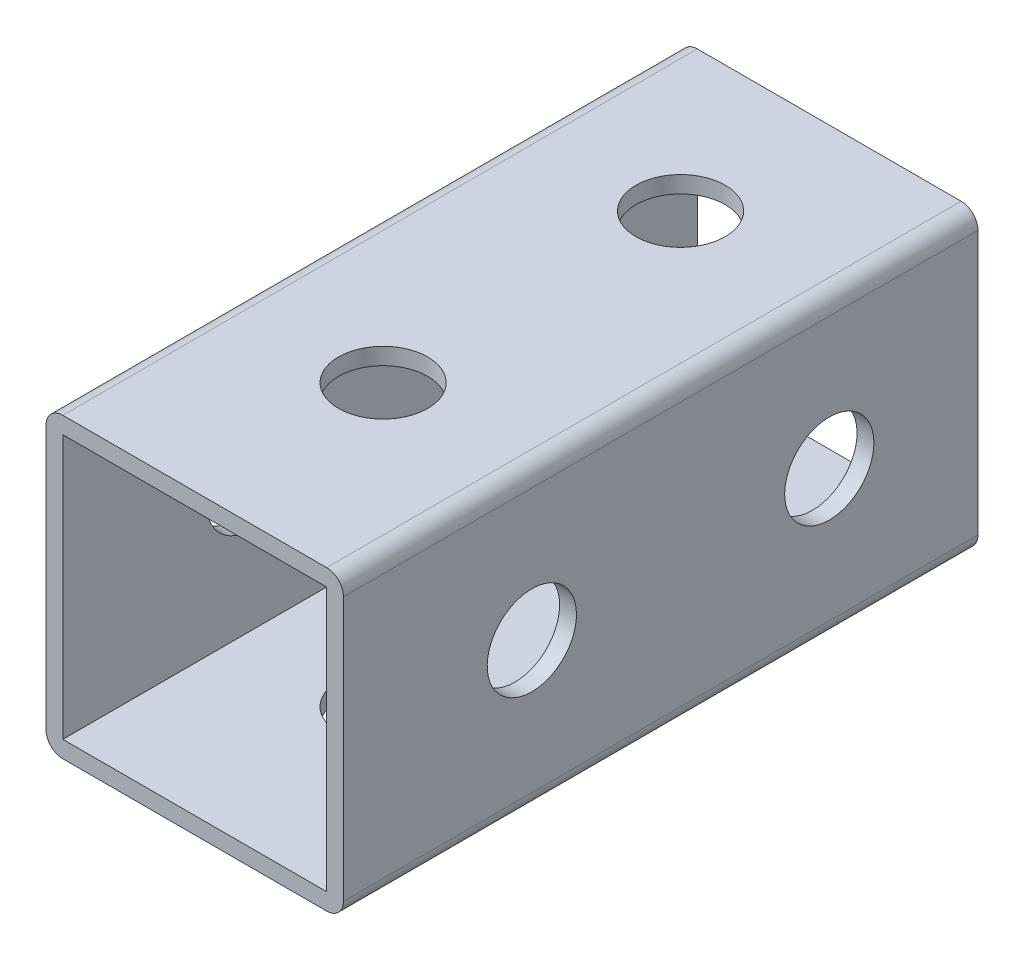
ISO-10303-21;
HEADER;
FILE_DESCRIPTION(('STEP AP214'),'2;1');
FILE_NAME('part.step','',(''),(''),'','','');
FILE_SCHEMA(('AUTOMOTIVE_DESIGN { 1 0 10303 214 1 1 1 1 }'));
ENDSEC;
DATA;
#1=APPLICATION_CONTEXT('core data for automotive mechanical design processes');
#2=APPLICATION_PROTOCOL_DEFINITION('international standard','automotive_design',2000,#1);
#3=PRODUCT_CONTEXT('',#1,'mechanical');
#4=PRODUCT('Part','Part','',(#3));
#5=PRODUCT_RELATED_PRODUCT_CATEGORY('part','',(#4));
#6=PRODUCT_DEFINITION_FORMATION('','',#4);
#7=PRODUCT_DEFINITION_CONTEXT('part definition',#1,'design');
#8=PRODUCT_DEFINITION('design','',#6,#7);
#9=PRODUCT_DEFINITION_SHAPE('','',#8);
#10=(LENGTH_UNIT() NAMED_UNIT(*) SI_UNIT(.MILLI.,.METRE.));
#11=(NAMED_UNIT(*) PLANE_ANGLE_UNIT() SI_UNIT($,.RADIAN.));
#12=(NAMED_UNIT(*) SI_UNIT($,.STERADIAN.) SOLID_ANGLE_UNIT());
#13=UNCERTAINTY_MEASURE_WITH_UNIT(LENGTH_MEASURE(1.E-05),#10,'distance_accuracy_value','');
#14=(GEOMETRIC_REPRESENTATION_CONTEXT(3) GLOBAL_UNCERTAINTY_ASSIGNED_CONTEXT((#13)) GLOBAL_UNIT_ASSIGNED_CONTEXT((#10,
#11,#12)) REPRESENTATION_CONTEXT('',''));
#15=CARTESIAN_POINT('',(0.,0.,0.));
#16=DIRECTION('',(0.,0.,1.));
#17=DIRECTION('',(1.,0.,0.));
#18=AXIS2_PLACEMENT_3D('',#15,#16,#17);
#19=CARTESIAN_POINT('',(21.1201,21.1201,101.6));
#20=DIRECTION('',(0.,0.,-1.));
#21=DIRECTION('',(-1.,0.,0.));
#22=AXIS2_PLACEMENT_3D('',#19,#20,#21);
#23=PLANE('',#22);
#24=CARTESIAN_POINT('',(21.1201,21.1201,101.6));
#25=DIRECTION('',(0.,0.,1.));
#26=DIRECTION('',(-1.,0.,0.));
#27=AXIS2_PLACEMENT_3D('',#24,#25,#26);
#28=CIRCLE('',#27,2.6924);
#29=CARTESIAN_POINT('',(23.8125,21.1201,101.6));
#30=VERTEX_POINT('',#29);
#31=CARTESIAN_POINT('',(21.1201,23.8125,101.6));
#32=VERTEX_POINT('',#31);
#33=EDGE_CURVE('E162',#30,#32,#28,.T.);
#34=ORIENTED_EDGE('',*,*,#33,.T.);
#35=DIRECTION('',(-1.,0.,0.));
#36=VECTOR('',#35,1.);
#37=CARTESIAN_POINT('',(-21.1201,23.8125,101.6));
#38=LINE('',#37,#36);
#39=CARTESIAN_POINT('',(-21.1201,23.8125,101.6));
#40=VERTEX_POINT('',#39);
#41=EDGE_CURVE('E165',#32,#40,#38,.T.);
#42=ORIENTED_EDGE('',*,*,#41,.T.);
#43=CARTESIAN_POINT('',(-21.1201,21.1201,101.6));
#44=DIRECTION('',(0.,0.,1.));
#45=DIRECTION('',(1.,0.,0.));
#46=AXIS2_PLACEMENT_3D('',#43,#44,#45);
#47=CIRCLE('',#46,2.69240000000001);
#48=CARTESIAN_POINT('',(-23.8125,21.1201,101.6));
#49=VERTEX_POINT('',#48);
#50=EDGE_CURVE('E168',#40,#49,#47,.T.);
#51=ORIENTED_EDGE('',*,*,#50,.T.);
#52=DIRECTION('',(0.,-1.,0.));
#53=VECTOR('',#52,1.);
#54=CARTESIAN_POINT('',(-23.8125,21.1201,101.6));
#55=LINE('',#54,#53);
#56=CARTESIAN_POINT('',(-23.8125,-21.1201,101.6));
#57=VERTEX_POINT('',#56);
#58=EDGE_CURVE('E170',#49,#57,#55,.T.);
#59=ORIENTED_EDGE('',*,*,#58,.T.);
#60=CARTESIAN_POINT('',(-21.1201,-21.1201,101.6));
#61=DIRECTION('',(0.,0.,1.));
#62=DIRECTION('',(-1.,0.,0.));
#63=AXIS2_PLACEMENT_3D('',#60,#61,#62);
#64=CIRCLE('',#63,2.69240000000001);
#65=CARTESIAN_POINT('',(-21.1201,-23.8125,101.6));
#66=VERTEX_POINT('',#65);
#67=EDGE_CURVE('E172',#57,#66,#64,.T.);
#68=ORIENTED_EDGE('',*,*,#67,.T.);
#69=DIRECTION('',(1.,0.,0.));
#70=VECTOR('',#69,1.);
#71=CARTESIAN_POINT('',(-21.1201,-23.8125,101.6));
#72=LINE('',#71,#70);
#73=CARTESIAN_POINT('',(21.1201,-23.8125,101.6));
#74=VERTEX_POINT('',#73);
#75=EDGE_CURVE('E174',#66,#74,#72,.T.);
#76=ORIENTED_EDGE('',*,*,#75,.T.);
#77=CARTESIAN_POINT('',(21.1201,-21.1201,101.6));
#78=DIRECTION('',(0.,0.,1.));
#79=DIRECTION('',(1.,0.,0.));
#80=AXIS2_PLACEMENT_3D('',#77,#78,#79);
#81=CIRCLE('',#80,2.6924);
#82=CARTESIAN_POINT('',(23.8125,-21.1201,101.6));
#83=VERTEX_POINT('',#82);
#84=EDGE_CURVE('E176',#74,#83,#81,.T.);
#85=ORIENTED_EDGE('',*,*,#84,.T.);
#86=DIRECTION('',(0.,1.,0.));
#87=VECTOR('',#86,1.);
#88=CARTESIAN_POINT('',(23.8125,-21.1201,101.6));
#89=LINE('',#88,#87);
#90=EDGE_CURVE('E178',#83,#30,#89,.T.);
#91=ORIENTED_EDGE('',*,*,#90,.T.);
#92=EDGE_LOOP('',(#34,#42,#51,#59,#68,#76,#85,#91));
#93=FACE_BOUND('',#92,.T.);
#94=DIRECTION('',(0.,1.,0.));
#95=VECTOR('',#94,1.);
#96=CARTESIAN_POINT('',(21.1201,-21.1201,101.6));
#97=LINE('',#96,#95);
#98=CARTESIAN_POINT('',(21.1201,-21.1201,101.6));
#99=VERTEX_POINT('',#98);
#100=CARTESIAN_POINT('',(21.1201,21.1201,101.6));
#101=VERTEX_POINT('',#100);
#102=EDGE_CURVE('E124',#99,#101,#97,.T.);
#103=ORIENTED_EDGE('',*,*,#102,.F.);
#104=DIRECTION('',(1.,0.,0.));
#105=VECTOR('',#104,1.);
#106=CARTESIAN_POINT('',(-21.1201,-21.1201,101.6));
#107=LINE('',#106,#105);
#108=CARTESIAN_POINT('',(-21.1201,-21.1201,101.6));
#109=VERTEX_POINT('',#108);
#110=EDGE_CURVE('E146',#109,#99,#107,.T.);
#111=ORIENTED_EDGE('',*,*,#110,.F.);
#112=DIRECTION('',(0.,-1.,0.));
#113=VECTOR('',#112,1.);
#114=CARTESIAN_POINT('',(-21.1201,21.1201,101.6));
#115=LINE('',#114,#113);
#116=CARTESIAN_POINT('',(-21.1201,21.1201,101.6));
#117=VERTEX_POINT('',#116);
#118=EDGE_CURVE('E144',#117,#109,#115,.T.);
#119=ORIENTED_EDGE('',*,*,#118,.F.);
#120=DIRECTION('',(-1.,0.,0.));
#121=VECTOR('',#120,1.);
#122=CARTESIAN_POINT('',(-21.1201,21.1201,101.6));
#123=LINE('',#122,#121);
#124=EDGE_CURVE('E132',#101,#117,#123,.T.);
#125=ORIENTED_EDGE('',*,*,#124,.F.);
#126=EDGE_LOOP('',(#103,#111,#119,#125));
#127=FACE_BOUND('',#126,.T.);
#128=ADVANCED_FACE('F33',(#93,#127),#23,.F.);
#129=CARTESIAN_POINT('',(21.1201,21.1201,0.));
#130=DIRECTION('',(0.,0.,-1.));
#131=DIRECTION('',(-1.,0.,0.));
#132=AXIS2_PLACEMENT_3D('',#129,#130,#131);
#133=PLANE('',#132);
#134=CARTESIAN_POINT('',(21.1201,21.1201,0.));
#135=DIRECTION('',(0.,0.,1.));
#136=DIRECTION('',(-1.,0.,0.));
#137=AXIS2_PLACEMENT_3D('',#134,#135,#136);
#138=CIRCLE('',#137,2.6924);
#139=CARTESIAN_POINT('',(23.8125,21.1201,0.));
#140=VERTEX_POINT('',#139);
#141=CARTESIAN_POINT('',(21.1201,23.8125,0.));
#142=VERTEX_POINT('',#141);
#143=EDGE_CURVE('E140',#140,#142,#138,.T.);
#144=ORIENTED_EDGE('',*,*,#143,.F.);
#145=DIRECTION('',(0.,1.,0.));
#146=VECTOR('',#145,1.);
#147=CARTESIAN_POINT('',(23.8125,-21.1201,0.));
#148=LINE('',#147,#146);
#149=CARTESIAN_POINT('',(23.8125,-21.1201,0.));
#150=VERTEX_POINT('',#149);
#151=EDGE_CURVE('E166',#150,#140,#148,.T.);
#152=ORIENTED_EDGE('',*,*,#151,.F.);
#153=CARTESIAN_POINT('',(21.1201,-21.1201,0.));
#154=DIRECTION('',(0.,0.,1.));
#155=DIRECTION('',(1.,0.,0.));
#156=AXIS2_PLACEMENT_3D('',#153,#154,#155);
#157=CIRCLE('',#156,2.6924);
#158=CARTESIAN_POINT('',(21.1201,-23.8125,0.));
#159=VERTEX_POINT('',#158);
#160=EDGE_CURVE('E193',#159,#150,#157,.T.);
#161=ORIENTED_EDGE('',*,*,#160,.F.);
#162=DIRECTION('',(1.,0.,0.));
#163=VECTOR('',#162,1.);
#164=CARTESIAN_POINT('',(-21.1201,-23.8125,0.));
#165=LINE('',#164,#163);
#166=CARTESIAN_POINT('',(-21.1201,-23.8125,0.));
#167=VERTEX_POINT('',#166);
#168=EDGE_CURVE('E191',#167,#159,#165,.T.);
#169=ORIENTED_EDGE('',*,*,#168,.F.);
#170=CARTESIAN_POINT('',(-21.1201,-21.1201,0.));
#171=DIRECTION('',(0.,0.,1.));
#172=DIRECTION('',(-1.,0.,0.));
#173=AXIS2_PLACEMENT_3D('',#170,#171,#172);
#174=CIRCLE('',#173,2.69240000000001);
#175=CARTESIAN_POINT('',(-23.8125,-21.1201,0.));
#176=VERTEX_POINT('',#175);
#177=EDGE_CURVE('E189',#176,#167,#174,.T.);
#178=ORIENTED_EDGE('',*,*,#177,.F.);
#179=DIRECTION('',(0.,-1.,0.));
#180=VECTOR('',#179,1.);
#181=CARTESIAN_POINT('',(-23.8125,21.1201,0.));
#182=LINE('',#181,#180);
#183=CARTESIAN_POINT('',(-23.8125,21.1201,0.));
#184=VERTEX_POINT('',#183);
#185=EDGE_CURVE('E187',#184,#176,#182,.T.);
#186=ORIENTED_EDGE('',*,*,#185,.F.);
#187=CARTESIAN_POINT('',(-21.1201,21.1201,0.));
#188=DIRECTION('',(0.,0.,1.));
#189=DIRECTION('',(1.,0.,0.));
#190=AXIS2_PLACEMENT_3D('',#187,#188,#189);
#191=CIRCLE('',#190,2.69240000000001);
#192=CARTESIAN_POINT('',(-21.1201,23.8125,0.));
#193=VERTEX_POINT('',#192);
#194=EDGE_CURVE('E185',#193,#184,#191,.T.);
#195=ORIENTED_EDGE('',*,*,#194,.F.);
#196=DIRECTION('',(-1.,0.,0.));
#197=VECTOR('',#196,1.);
#198=CARTESIAN_POINT('',(-21.1201,23.8125,0.));
#199=LINE('',#198,#197);
#200=EDGE_CURVE('E183',#142,#193,#199,.T.);
#201=ORIENTED_EDGE('',*,*,#200,.F.);
#202=EDGE_LOOP('',(#144,#152,#161,#169,#178,#186,#195,#201));
#203=FACE_BOUND('',#202,.T.);
#204=DIRECTION('',(1.,0.,0.));
#205=VECTOR('',#204,1.);
#206=CARTESIAN_POINT('',(-21.1201,-21.1201,0.));
#207=LINE('',#206,#205);
#208=CARTESIAN_POINT('',(-21.1201,-21.1201,0.));
#209=VERTEX_POINT('',#208);
#210=CARTESIAN_POINT('',(21.1201,-21.1201,0.));
#211=VERTEX_POINT('',#210);
#212=EDGE_CURVE('E133',#209,#211,#207,.T.);
#213=ORIENTED_EDGE('',*,*,#212,.T.);
#214=DIRECTION('',(0.,1.,0.));
#215=VECTOR('',#214,1.);
#216=CARTESIAN_POINT('',(21.1201,-21.1201,0.));
#217=LINE('',#216,#215);
#218=CARTESIAN_POINT('',(21.1201,21.1201,0.));
#219=VERTEX_POINT('',#218);
#220=EDGE_CURVE('E58',#211,#219,#217,.T.);
#221=ORIENTED_EDGE('',*,*,#220,.T.);
#222=DIRECTION('',(-1.,0.,0.));
#223=VECTOR('',#222,1.);
#224=CARTESIAN_POINT('',(-21.1201,21.1201,0.));
#225=LINE('',#224,#223);
#226=CARTESIAN_POINT('',(-21.1201,21.1201,0.));
#227=VERTEX_POINT('',#226);
#228=EDGE_CURVE('E139',#219,#227,#225,.T.);
#229=ORIENTED_EDGE('',*,*,#228,.T.);
#230=DIRECTION('',(0.,-1.,0.));
#231=VECTOR('',#230,1.);
#232=CARTESIAN_POINT('',(-21.1201,21.1201,0.));
#233=LINE('',#232,#231);
#234=EDGE_CURVE('E154',#227,#209,#233,.T.);
#235=ORIENTED_EDGE('',*,*,#234,.T.);
#236=EDGE_LOOP('',(#213,#221,#229,#235));
#237=FACE_BOUND('',#236,.T.);
#238=ADVANCED_FACE('F282',(#203,#237),#133,.T.);
#239=CARTESIAN_POINT('',(21.1201,21.1201,101.6));
#240=DIRECTION('',(0.,0.,-1.));
#241=DIRECTION('',(-1.,0.,0.));
#242=AXIS2_PLACEMENT_3D('',#239,#240,#241);
#243=CYLINDRICAL_SURFACE('',#242,2.6924);
#244=ORIENTED_EDGE('',*,*,#143,.T.);
#245=DIRECTION('',(0.,0.,-1.));
#246=VECTOR('',#245,1.);
#247=CARTESIAN_POINT('',(21.1201,23.8125,101.6));
#248=LINE('',#247,#246);
#249=EDGE_CURVE('E11',#32,#142,#248,.T.);
#250=ORIENTED_EDGE('',*,*,#249,.F.);
#251=ORIENTED_EDGE('',*,*,#33,.F.);
#252=DIRECTION('',(0.,0.,-1.));
#253=VECTOR('',#252,1.);
#254=CARTESIAN_POINT('',(23.8125,21.1201,101.6));
#255=LINE('',#254,#253);
#256=EDGE_CURVE('E180',#30,#140,#255,.T.);
#257=ORIENTED_EDGE('',*,*,#256,.T.);
#258=EDGE_LOOP('',(#244,#250,#251,#257));
#259=FACE_BOUND('',#258,.T.);
#260=ADVANCED_FACE('F35',(#259),#243,.T.);
#261=CARTESIAN_POINT('',(-21.1201,23.8125,101.6));
#262=DIRECTION('',(0.,-1.,0.));
#263=DIRECTION('',(1.,0.,0.));
#264=AXIS2_PLACEMENT_3D('',#261,#262,#263);
#265=PLANE('',#264);
#266=CARTESIAN_POINT('',(0.,23.8125,71.4375));
#267=DIRECTION('',(0.,1.,0.));
#268=DIRECTION('',(-1.,0.,0.));
#269=AXIS2_PLACEMENT_3D('',#266,#267,#268);
#270=CIRCLE('',#269,7.14375);
#271=CARTESIAN_POINT('',(-7.14375,23.8125,71.4375));
#272=VERTEX_POINT('',#271);
#273=EDGE_CURVE('E234',#272,#272,#270,.T.);
#274=ORIENTED_EDGE('',*,*,#273,.F.);
#275=EDGE_LOOP('',(#274));
#276=FACE_BOUND('',#275,.T.);
#277=CARTESIAN_POINT('',(0.,23.8125,23.8125));
#278=DIRECTION('',(0.,1.,0.));
#279=DIRECTION('',(-1.,0.,0.));
#280=AXIS2_PLACEMENT_3D('',#277,#278,#279);
#281=CIRCLE('',#280,7.14375);
#282=CARTESIAN_POINT('',(-7.14375,23.8125,23.8125));
#283=VERTEX_POINT('',#282);
#284=EDGE_CURVE('E256',#283,#283,#281,.T.);
#285=ORIENTED_EDGE('',*,*,#284,.F.);
#286=EDGE_LOOP('',(#285));
#287=FACE_BOUND('',#286,.T.);
#288=ORIENTED_EDGE('',*,*,#200,.T.);
#289=DIRECTION('',(0.,0.,-1.));
#290=VECTOR('',#289,1.);
#291=CARTESIAN_POINT('',(-21.1201,23.8125,101.6));
#292=LINE('',#291,#290);
#293=EDGE_CURVE('E42',#40,#193,#292,.T.);
#294=ORIENTED_EDGE('',*,*,#293,.F.);
#295=ORIENTED_EDGE('',*,*,#41,.F.);
#296=ORIENTED_EDGE('',*,*,#249,.T.);
#297=EDGE_LOOP('',(#288,#294,#295,#296));
#298=FACE_BOUND('',#297,.T.);
#299=ADVANCED_FACE('F311',(#276,#287,#298),#265,.F.);
#300=CARTESIAN_POINT('',(-21.1201,21.1201,101.6));
#301=DIRECTION('',(0.,0.,-1.));
#302=DIRECTION('',(-1.,0.,0.));
#303=AXIS2_PLACEMENT_3D('',#300,#301,#302);
#304=CYLINDRICAL_SURFACE('',#303,2.69240000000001);
#305=ORIENTED_EDGE('',*,*,#194,.T.);
#306=DIRECTION('',(0.,0.,-1.));
#307=VECTOR('',#306,1.);
#308=CARTESIAN_POINT('',(-23.8125,21.1201,101.6));
#309=LINE('',#308,#307);
#310=EDGE_CURVE('E210',#49,#184,#309,.T.);
#311=ORIENTED_EDGE('',*,*,#310,.F.);
#312=ORIENTED_EDGE('',*,*,#50,.F.);
#313=ORIENTED_EDGE('',*,*,#293,.T.);
#314=EDGE_LOOP('',(#305,#311,#312,#313));
#315=FACE_BOUND('',#314,.T.);
#316=ADVANCED_FACE('F308',(#315),#304,.T.);
#317=CARTESIAN_POINT('',(-23.8125,21.1201,101.6));
#318=DIRECTION('',(1.,0.,0.));
#319=DIRECTION('',(0.,0.,-1.));
#320=AXIS2_PLACEMENT_3D('',#317,#318,#319);
#321=PLANE('',#320);
#322=CARTESIAN_POINT('',(-23.8125,0.,71.4375));
#323=DIRECTION('',(-1.,0.,0.));
#324=DIRECTION('',(0.,-1.,0.));
#325=AXIS2_PLACEMENT_3D('',#322,#323,#324);
#326=CIRCLE('',#325,7.14375);
#327=CARTESIAN_POINT('',(-23.8125,-7.14375000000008,71.4375));
#328=VERTEX_POINT('',#327);
#329=EDGE_CURVE('E236',#328,#328,#326,.T.);
#330=ORIENTED_EDGE('',*,*,#329,.F.);
#331=EDGE_LOOP('',(#330));
#332=FACE_BOUND('',#331,.T.);
#333=CARTESIAN_POINT('',(-23.8125,0.,23.8125));
#334=DIRECTION('',(-1.,0.,0.));
#335=DIRECTION('',(0.,-1.,0.));
#336=AXIS2_PLACEMENT_3D('',#333,#334,#335);
#337=CIRCLE('',#336,7.14375);
#338=CARTESIAN_POINT('',(-23.8125,-7.14375000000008,23.8125));
#339=VERTEX_POINT('',#338);
#340=EDGE_CURVE('E249',#339,#339,#337,.T.);
#341=ORIENTED_EDGE('',*,*,#340,.F.);
#342=EDGE_LOOP('',(#341));
#343=FACE_BOUND('',#342,.T.);
#344=ORIENTED_EDGE('',*,*,#185,.T.);
#345=DIRECTION('',(0.,0.,-1.));
#346=VECTOR('',#345,1.);
#347=CARTESIAN_POINT('',(-23.8125,-21.1201,101.6));
#348=LINE('',#347,#346);
#349=EDGE_CURVE('E207',#57,#176,#348,.T.);
#350=ORIENTED_EDGE('',*,*,#349,.F.);
#351=ORIENTED_EDGE('',*,*,#58,.F.);
#352=ORIENTED_EDGE('',*,*,#310,.T.);
#353=EDGE_LOOP('',(#344,#350,#351,#352));
#354=FACE_BOUND('',#353,.T.);
#355=ADVANCED_FACE('F304',(#332,#343,#354),#321,.F.);
#356=CARTESIAN_POINT('',(-21.1201,-21.1201,101.6));
#357=DIRECTION('',(0.,0.,-1.));
#358=DIRECTION('',(-1.,0.,0.));
#359=AXIS2_PLACEMENT_3D('',#356,#357,#358);
#360=CYLINDRICAL_SURFACE('',#359,2.69240000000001);
#361=ORIENTED_EDGE('',*,*,#177,.T.);
#362=DIRECTION('',(0.,0.,-1.));
#363=VECTOR('',#362,1.);
#364=CARTESIAN_POINT('',(-21.1201,-23.8125,101.6));
#365=LINE('',#364,#363);
#366=EDGE_CURVE('E204',#66,#167,#365,.T.);
#367=ORIENTED_EDGE('',*,*,#366,.F.);
#368=ORIENTED_EDGE('',*,*,#67,.F.);
#369=ORIENTED_EDGE('',*,*,#349,.T.);
#370=EDGE_LOOP('',(#361,#367,#368,#369));
#371=FACE_BOUND('',#370,.T.);
#372=ADVANCED_FACE('F300',(#371),#360,.T.);
#373=CARTESIAN_POINT('',(-21.1201,-23.8125,101.6));
#374=DIRECTION('',(0.,1.,0.));
#375=DIRECTION('',(-1.,0.,0.));
#376=AXIS2_PLACEMENT_3D('',#373,#374,#375);
#377=PLANE('',#376);
#378=CARTESIAN_POINT('',(0.,-23.8125,71.4375));
#379=DIRECTION('',(0.,1.,0.));
#380=DIRECTION('',(-1.,0.,0.));
#381=AXIS2_PLACEMENT_3D('',#378,#379,#380);
#382=CIRCLE('',#381,7.14375);
#383=CARTESIAN_POINT('',(-7.14375,-23.8125,71.4375));
#384=VERTEX_POINT('',#383);
#385=EDGE_CURVE('E227',#384,#384,#382,.T.);
#386=ORIENTED_EDGE('',*,*,#385,.T.);
#387=EDGE_LOOP('',(#386));
#388=FACE_BOUND('',#387,.T.);
#389=CARTESIAN_POINT('',(0.,-23.8125,23.8125));
#390=DIRECTION('',(0.,1.,0.));
#391=DIRECTION('',(-1.,0.,0.));
#392=AXIS2_PLACEMENT_3D('',#389,#390,#391);
#393=CIRCLE('',#392,7.14375);
#394=CARTESIAN_POINT('',(-7.14375,-23.8125,23.8125));
#395=VERTEX_POINT('',#394);
#396=EDGE_CURVE('E218',#395,#395,#393,.T.);
#397=ORIENTED_EDGE('',*,*,#396,.T.);
#398=EDGE_LOOP('',(#397));
#399=FACE_BOUND('',#398,.T.);
#400=ORIENTED_EDGE('',*,*,#168,.T.);
#401=DIRECTION('',(0.,0.,-1.));
#402=VECTOR('',#401,1.);
#403=CARTESIAN_POINT('',(21.1201,-23.8125,101.6));
#404=LINE('',#403,#402);
#405=EDGE_CURVE('E201',#74,#159,#404,.T.);
#406=ORIENTED_EDGE('',*,*,#405,.F.);
#407=ORIENTED_EDGE('',*,*,#75,.F.);
#408=ORIENTED_EDGE('',*,*,#366,.T.);
#409=EDGE_LOOP('',(#400,#406,#407,#408));
#410=FACE_BOUND('',#409,.T.);
#411=ADVANCED_FACE('F296',(#388,#399,#410),#377,.F.);
#412=CARTESIAN_POINT('',(21.1201,-21.1201,101.6));
#413=DIRECTION('',(0.,0.,-1.));
#414=DIRECTION('',(-1.,0.,0.));
#415=AXIS2_PLACEMENT_3D('',#412,#413,#414);
#416=CYLINDRICAL_SURFACE('',#415,2.6924);
#417=ORIENTED_EDGE('',*,*,#160,.T.);
#418=DIRECTION('',(0.,0.,-1.));
#419=VECTOR('',#418,1.);
#420=CARTESIAN_POINT('',(23.8125,-21.1201,101.6));
#421=LINE('',#420,#419);
#422=EDGE_CURVE('E198',#83,#150,#421,.T.);
#423=ORIENTED_EDGE('',*,*,#422,.F.);
#424=ORIENTED_EDGE('',*,*,#84,.F.);
#425=ORIENTED_EDGE('',*,*,#405,.T.);
#426=EDGE_LOOP('',(#417,#423,#424,#425));
#427=FACE_BOUND('',#426,.T.);
#428=ADVANCED_FACE('F293',(#427),#416,.T.);
#429=CARTESIAN_POINT('',(23.8125,-21.1201,101.6));
#430=DIRECTION('',(-1.,0.,0.));
#431=DIRECTION('',(0.,0.,1.));
#432=AXIS2_PLACEMENT_3D('',#429,#430,#431);
#433=PLANE('',#432);
#434=CARTESIAN_POINT('',(23.8125000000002,0.,71.4375));
#435=DIRECTION('',(-1.,0.,0.));
#436=DIRECTION('',(0.,-1.,0.));
#437=AXIS2_PLACEMENT_3D('',#434,#435,#436);
#438=CIRCLE('',#437,7.14375);
#439=CARTESIAN_POINT('',(23.8125000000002,-7.14374999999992,71.4375));
#440=VERTEX_POINT('',#439);
#441=EDGE_CURVE('E230',#440,#440,#438,.T.);
#442=ORIENTED_EDGE('',*,*,#441,.T.);
#443=EDGE_LOOP('',(#442));
#444=FACE_BOUND('',#443,.T.);
#445=CARTESIAN_POINT('',(23.8125000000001,0.,23.8125));
#446=DIRECTION('',(-1.,0.,0.));
#447=DIRECTION('',(0.,-1.,0.));
#448=AXIS2_PLACEMENT_3D('',#445,#446,#447);
#449=CIRCLE('',#448,7.14375);
#450=CARTESIAN_POINT('',(23.8125000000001,-7.14374999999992,23.8125));
#451=VERTEX_POINT('',#450);
#452=EDGE_CURVE('E223',#451,#451,#449,.T.);
#453=ORIENTED_EDGE('',*,*,#452,.T.);
#454=EDGE_LOOP('',(#453));
#455=FACE_BOUND('',#454,.T.);
#456=ORIENTED_EDGE('',*,*,#151,.T.);
#457=ORIENTED_EDGE('',*,*,#256,.F.);
#458=ORIENTED_EDGE('',*,*,#90,.F.);
#459=ORIENTED_EDGE('',*,*,#422,.T.);
#460=EDGE_LOOP('',(#456,#457,#458,#459));
#461=FACE_BOUND('',#460,.T.);
#462=ADVANCED_FACE('F277',(#444,#455,#461),#433,.F.);
#463=CARTESIAN_POINT('',(21.1201,-21.1201,101.6));
#464=DIRECTION('',(-1.,0.,0.));
#465=DIRECTION('',(0.,0.,1.));
#466=AXIS2_PLACEMENT_3D('',#463,#464,#465);
#467=PLANE('',#466);
#468=CARTESIAN_POINT('',(21.1201,0.,71.4375));
#469=DIRECTION('',(-1.,0.,0.));
#470=DIRECTION('',(0.,0.,1.));
#471=AXIS2_PLACEMENT_3D('',#468,#469,#470);
#472=CIRCLE('',#471,7.14375);
#473=CARTESIAN_POINT('',(21.1201,-7.14374999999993,71.4375));
#474=VERTEX_POINT('',#473);
#475=EDGE_CURVE('E37',#474,#474,#472,.T.);
#476=ORIENTED_EDGE('',*,*,#475,.F.);
#477=EDGE_LOOP('',(#476));
#478=FACE_BOUND('',#477,.T.);
#479=CARTESIAN_POINT('',(21.1201,0.,23.8125));
#480=DIRECTION('',(-1.,0.,0.));
#481=DIRECTION('',(0.,0.,1.));
#482=AXIS2_PLACEMENT_3D('',#479,#480,#481);
#483=CIRCLE('',#482,7.14375);
#484=CARTESIAN_POINT('',(21.1201,0.,30.95625));
#485=VERTEX_POINT('',#484);
#486=EDGE_CURVE('E222',#485,#485,#483,.T.);
#487=ORIENTED_EDGE('',*,*,#486,.F.);
#488=EDGE_LOOP('',(#487));
#489=FACE_BOUND('',#488,.T.);
#490=ORIENTED_EDGE('',*,*,#220,.F.);
#491=DIRECTION('',(0.,0.,-1.));
#492=VECTOR('',#491,1.);
#493=CARTESIAN_POINT('',(21.1201,-21.1201,101.6));
#494=LINE('',#493,#492);
#495=EDGE_CURVE('E128',#99,#211,#494,.T.);
#496=ORIENTED_EDGE('',*,*,#495,.F.);
#497=ORIENTED_EDGE('',*,*,#102,.T.);
#498=DIRECTION('',(0.,0.,-1.));
#499=VECTOR('',#498,1.);
#500=CARTESIAN_POINT('',(21.1201,21.1201,101.6));
#501=LINE('',#500,#499);
#502=EDGE_CURVE('E127',#101,#219,#501,.T.);
#503=ORIENTED_EDGE('',*,*,#502,.T.);
#504=EDGE_LOOP('',(#490,#496,#497,#503));
#505=FACE_BOUND('',#504,.T.);
#506=ADVANCED_FACE('F126',(#478,#489,#505),#467,.T.);
#507=CARTESIAN_POINT('',(-21.1201,21.1201,101.6));
#508=DIRECTION('',(0.,-1.,0.));
#509=DIRECTION('',(1.,0.,0.));
#510=AXIS2_PLACEMENT_3D('',#507,#508,#509);
#511=PLANE('',#510);
#512=CARTESIAN_POINT('',(0.,21.1201,71.4375));
#513=DIRECTION('',(0.,-1.,0.));
#514=DIRECTION('',(1.,0.,0.));
#515=AXIS2_PLACEMENT_3D('',#512,#513,#514);
#516=CIRCLE('',#515,7.14375);
#517=CARTESIAN_POINT('',(7.14375,21.1201,71.4375));
#518=VERTEX_POINT('',#517);
#519=EDGE_CURVE('E226',#518,#518,#516,.T.);
#520=ORIENTED_EDGE('',*,*,#519,.F.);
#521=EDGE_LOOP('',(#520));
#522=FACE_BOUND('',#521,.T.);
#523=CARTESIAN_POINT('',(0.,21.1201,23.8125));
#524=DIRECTION('',(0.,-1.,0.));
#525=DIRECTION('',(1.,0.,0.));
#526=AXIS2_PLACEMENT_3D('',#523,#524,#525);
#527=CIRCLE('',#526,7.14375);
#528=CARTESIAN_POINT('',(7.14375,21.1201,23.8125));
#529=VERTEX_POINT('',#528);
#530=EDGE_CURVE('E152',#529,#529,#527,.T.);
#531=ORIENTED_EDGE('',*,*,#530,.F.);
#532=EDGE_LOOP('',(#531));
#533=FACE_BOUND('',#532,.T.);
#534=ORIENTED_EDGE('',*,*,#228,.F.);
#535=ORIENTED_EDGE('',*,*,#502,.F.);
#536=ORIENTED_EDGE('',*,*,#124,.T.);
#537=DIRECTION('',(0.,0.,-1.));
#538=VECTOR('',#537,1.);
#539=CARTESIAN_POINT('',(-21.1201,21.1201,101.6));
#540=LINE('',#539,#538);
#541=EDGE_CURVE('E141',#117,#227,#540,.T.);
#542=ORIENTED_EDGE('',*,*,#541,.T.);
#543=EDGE_LOOP('',(#534,#535,#536,#542));
#544=FACE_BOUND('',#543,.T.);
#545=ADVANCED_FACE('F136',(#522,#533,#544),#511,.T.);
#546=CARTESIAN_POINT('',(-21.1201,21.1201,101.6));
#547=DIRECTION('',(1.,0.,0.));
#548=DIRECTION('',(0.,0.,-1.));
#549=AXIS2_PLACEMENT_3D('',#546,#547,#548);
#550=PLANE('',#549);
#551=CARTESIAN_POINT('',(-21.1201,0.,71.4375));
#552=DIRECTION('',(1.,0.,0.));
#553=DIRECTION('',(0.,0.,-1.));
#554=AXIS2_PLACEMENT_3D('',#551,#552,#553);
#555=CIRCLE('',#554,7.14375);
#556=CARTESIAN_POINT('',(-21.1201,-7.14375000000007,71.4375));
#557=VERTEX_POINT('',#556);
#558=EDGE_CURVE('E228',#557,#557,#555,.T.);
#559=ORIENTED_EDGE('',*,*,#558,.F.);
#560=EDGE_LOOP('',(#559));
#561=FACE_BOUND('',#560,.T.);
#562=CARTESIAN_POINT('',(-21.1201,0.,23.8125));
#563=DIRECTION('',(1.,0.,0.));
#564=DIRECTION('',(0.,0.,-1.));
#565=AXIS2_PLACEMENT_3D('',#562,#563,#564);
#566=CIRCLE('',#565,7.14375);
#567=CARTESIAN_POINT('',(-21.1201,0.,16.66875));
#568=VERTEX_POINT('',#567);
#569=EDGE_CURVE('E219',#568,#568,#566,.T.);
#570=ORIENTED_EDGE('',*,*,#569,.F.);
#571=EDGE_LOOP('',(#570));
#572=FACE_BOUND('',#571,.T.);
#573=ORIENTED_EDGE('',*,*,#234,.F.);
#574=ORIENTED_EDGE('',*,*,#541,.F.);
#575=ORIENTED_EDGE('',*,*,#118,.T.);
#576=DIRECTION('',(0.,0.,-1.));
#577=VECTOR('',#576,1.);
#578=CARTESIAN_POINT('',(-21.1201,-21.1201,101.6));
#579=LINE('',#578,#577);
#580=EDGE_CURVE('E50',#109,#209,#579,.T.);
#581=ORIENTED_EDGE('',*,*,#580,.T.);
#582=EDGE_LOOP('',(#573,#574,#575,#581));
#583=FACE_BOUND('',#582,.T.);
#584=ADVANCED_FACE('F267',(#561,#572,#583),#550,.T.);
#585=CARTESIAN_POINT('',(-21.1201,-21.1201,101.6));
#586=DIRECTION('',(0.,1.,0.));
#587=DIRECTION('',(-1.,0.,0.));
#588=AXIS2_PLACEMENT_3D('',#585,#586,#587);
#589=PLANE('',#588);
#590=CARTESIAN_POINT('',(0.,-21.1201,71.4375));
#591=DIRECTION('',(0.,1.,0.));
#592=DIRECTION('',(-1.,0.,0.));
#593=AXIS2_PLACEMENT_3D('',#590,#591,#592);
#594=CIRCLE('',#593,7.14375);
#595=CARTESIAN_POINT('',(-7.14375,-21.1201,71.4375));
#596=VERTEX_POINT('',#595);
#597=EDGE_CURVE('E224',#596,#596,#594,.T.);
#598=ORIENTED_EDGE('',*,*,#597,.F.);
#599=EDGE_LOOP('',(#598));
#600=FACE_BOUND('',#599,.T.);
#601=CARTESIAN_POINT('',(0.,-21.1201,23.8125));
#602=DIRECTION('',(0.,1.,0.));
#603=DIRECTION('',(-1.,0.,0.));
#604=AXIS2_PLACEMENT_3D('',#601,#602,#603);
#605=CIRCLE('',#604,7.14375);
#606=CARTESIAN_POINT('',(-7.14375,-21.1201,23.8125));
#607=VERTEX_POINT('',#606);
#608=EDGE_CURVE('E215',#607,#607,#605,.T.);
#609=ORIENTED_EDGE('',*,*,#608,.F.);
#610=EDGE_LOOP('',(#609));
#611=FACE_BOUND('',#610,.T.);
#612=ORIENTED_EDGE('',*,*,#212,.F.);
#613=ORIENTED_EDGE('',*,*,#580,.F.);
#614=ORIENTED_EDGE('',*,*,#110,.T.);
#615=ORIENTED_EDGE('',*,*,#495,.T.);
#616=EDGE_LOOP('',(#612,#613,#614,#615));
#617=FACE_BOUND('',#616,.T.);
#618=ADVANCED_FACE('F274',(#600,#611,#617),#589,.T.);
#619=CARTESIAN_POINT('',(0.,-23.8125,23.8125));
#620=DIRECTION('',(0.,1.,0.));
#621=DIRECTION('',(-1.,0.,0.));
#622=AXIS2_PLACEMENT_3D('',#619,#620,#621);
#623=CYLINDRICAL_SURFACE('',#622,7.14375);
#624=ORIENTED_EDGE('',*,*,#608,.T.);
#625=EDGE_LOOP('',(#624));
#626=FACE_BOUND('',#625,.T.);
#627=ORIENTED_EDGE('',*,*,#396,.F.);
#628=EDGE_LOOP('',(#627));
#629=FACE_BOUND('',#628,.T.);
#630=ADVANCED_FACE('F351',(#626,#629),#623,.F.);
#631=ORIENTED_EDGE('',*,*,#530,.T.);
#632=EDGE_LOOP('',(#631));
#633=FACE_BOUND('',#632,.T.);
#634=ORIENTED_EDGE('',*,*,#284,.T.);
#635=EDGE_LOOP('',(#634));
#636=FACE_BOUND('',#635,.T.);
#637=ADVANCED_FACE('F263',(#633,#636),#623,.F.);
#638=CARTESIAN_POINT('',(23.8125000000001,0.,23.8125));
#639=DIRECTION('',(-1.,0.,0.));
#640=DIRECTION('',(0.,-1.,0.));
#641=AXIS2_PLACEMENT_3D('',#638,#639,#640);
#642=CYLINDRICAL_SURFACE('',#641,7.14375);
#643=ORIENTED_EDGE('',*,*,#569,.T.);
#644=EDGE_LOOP('',(#643));
#645=FACE_BOUND('',#644,.T.);
#646=ORIENTED_EDGE('',*,*,#340,.T.);
#647=EDGE_LOOP('',(#646));
#648=FACE_BOUND('',#647,.T.);
#649=ADVANCED_FACE('F362',(#645,#648),#642,.F.);
#650=ORIENTED_EDGE('',*,*,#486,.T.);
#651=EDGE_LOOP('',(#650));
#652=FACE_BOUND('',#651,.T.);
#653=ORIENTED_EDGE('',*,*,#452,.F.);
#654=EDGE_LOOP('',(#653));
#655=FACE_BOUND('',#654,.T.);
#656=ADVANCED_FACE('F365',(#652,#655),#642,.F.);
#657=CARTESIAN_POINT('',(0.,-23.8125,71.4375));
#658=DIRECTION('',(0.,1.,0.));
#659=DIRECTION('',(-1.,0.,0.));
#660=AXIS2_PLACEMENT_3D('',#657,#658,#659);
#661=CYLINDRICAL_SURFACE('',#660,7.14375);
#662=ORIENTED_EDGE('',*,*,#597,.T.);
#663=EDGE_LOOP('',(#662));
#664=FACE_BOUND('',#663,.T.);
#665=ORIENTED_EDGE('',*,*,#385,.F.);
#666=EDGE_LOOP('',(#665));
#667=FACE_BOUND('',#666,.T.);
#668=ADVANCED_FACE('F367',(#664,#667),#661,.F.);
#669=ORIENTED_EDGE('',*,*,#519,.T.);
#670=EDGE_LOOP('',(#669));
#671=FACE_BOUND('',#670,.T.);
#672=ORIENTED_EDGE('',*,*,#273,.T.);
#673=EDGE_LOOP('',(#672));
#674=FACE_BOUND('',#673,.T.);
#675=ADVANCED_FACE('F370',(#671,#674),#661,.F.);
#676=CARTESIAN_POINT('',(23.8125000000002,0.,71.4375));
#677=DIRECTION('',(-1.,0.,0.));
#678=DIRECTION('',(0.,-1.,0.));
#679=AXIS2_PLACEMENT_3D('',#676,#677,#678);
#680=CYLINDRICAL_SURFACE('',#679,7.14375);
#681=CARTESIAN_POINT('',(-21.1201,-7.14375000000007,71.4375));
#682=CARTESIAN_POINT('',(-21.1481458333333,-7.14375000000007,71.4375));
#683=CARTESIAN_POINT('',(-21.1761916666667,-7.14375000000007,71.4375));
#684=CARTESIAN_POINT('',(-21.2322833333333,-7.14375000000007,71.4375));
#685=CARTESIAN_POINT('',(-21.2603291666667,-7.14375000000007,71.4375));
#686=CARTESIAN_POINT('',(-21.3164208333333,-7.14375000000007,71.4375));
#687=CARTESIAN_POINT('',(-21.3444666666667,-7.14375000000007,71.4375));
#688=CARTESIAN_POINT('',(-21.4005583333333,-7.14375000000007,71.4375));
#689=CARTESIAN_POINT('',(-21.4286041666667,-7.14375000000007,71.4375));
#690=CARTESIAN_POINT('',(-21.4846958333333,-7.14375000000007,71.4375));
#691=CARTESIAN_POINT('',(-21.5127416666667,-7.14375000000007,71.4375));
#692=CARTESIAN_POINT('',(-21.5688333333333,-7.14375000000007,71.4375));
#693=CARTESIAN_POINT('',(-21.5968791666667,-7.14375000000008,71.4375));
#694=CARTESIAN_POINT('',(-21.6529708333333,-7.14375000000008,71.4375));
#695=CARTESIAN_POINT('',(-21.6810166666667,-7.14375000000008,71.4375));
#696=CARTESIAN_POINT('',(-21.7371083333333,-7.14375000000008,71.4375));
#697=CARTESIAN_POINT('',(-21.7651541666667,-7.14375000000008,71.4375));
#698=CARTESIAN_POINT('',(-21.8212458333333,-7.14375000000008,71.4375));
#699=CARTESIAN_POINT('',(-21.8492916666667,-7.14375000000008,71.4375));
#700=CARTESIAN_POINT('',(-21.9053833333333,-7.14375000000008,71.4375));
#701=CARTESIAN_POINT('',(-21.9334291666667,-7.14375000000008,71.4375));
#702=CARTESIAN_POINT('',(-21.9895208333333,-7.14375000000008,71.4375));
#703=CARTESIAN_POINT('',(-22.0175666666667,-7.14375000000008,71.4375));
#704=CARTESIAN_POINT('',(-22.0736583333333,-7.14375000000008,71.4375));
#705=CARTESIAN_POINT('',(-22.1017041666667,-7.14375000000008,71.4375));
#706=CARTESIAN_POINT('',(-22.1577958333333,-7.14375000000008,71.4375));
#707=CARTESIAN_POINT('',(-22.1858416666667,-7.14375000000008,71.4375));
#708=CARTESIAN_POINT('',(-22.2419333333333,-7.14375000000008,71.4375));
#709=CARTESIAN_POINT('',(-22.2699791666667,-7.14375000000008,71.4375));
#710=CARTESIAN_POINT('',(-22.3260708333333,-7.14375000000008,71.4375));
#711=CARTESIAN_POINT('',(-22.3541166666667,-7.14375000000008,71.4375));
#712=CARTESIAN_POINT('',(-22.4102083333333,-7.14375000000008,71.4375));
#713=CARTESIAN_POINT('',(-22.4382541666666,-7.14375000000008,71.4375));
#714=CARTESIAN_POINT('',(-22.4943458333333,-7.14375000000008,71.4375));
#715=CARTESIAN_POINT('',(-22.5223916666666,-7.14375000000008,71.4375));
#716=CARTESIAN_POINT('',(-22.5784833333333,-7.14375000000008,71.4375));
#717=CARTESIAN_POINT('',(-22.6065291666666,-7.14375000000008,71.4375));
#718=CARTESIAN_POINT('',(-22.6626208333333,-7.14375000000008,71.4375));
#719=CARTESIAN_POINT('',(-22.6906666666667,-7.14375000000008,71.4375));
#720=CARTESIAN_POINT('',(-22.7467583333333,-7.14375000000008,71.4375));
#721=CARTESIAN_POINT('',(-22.7748041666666,-7.14375000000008,71.4375));
#722=CARTESIAN_POINT('',(-22.8308958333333,-7.14375000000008,71.4375));
#723=CARTESIAN_POINT('',(-22.8589416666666,-7.14375000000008,71.4375));
#724=CARTESIAN_POINT('',(-22.9150333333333,-7.14375000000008,71.4375));
#725=CARTESIAN_POINT('',(-22.9430791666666,-7.14375000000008,71.4375));
#726=CARTESIAN_POINT('',(-22.9991708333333,-7.14375000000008,71.4375));
#727=CARTESIAN_POINT('',(-23.0272166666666,-7.14375000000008,71.4375));
#728=CARTESIAN_POINT('',(-23.0833083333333,-7.14375000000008,71.4375));
#729=CARTESIAN_POINT('',(-23.1113541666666,-7.14375000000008,71.4375));
#730=CARTESIAN_POINT('',(-23.1674458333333,-7.14375000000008,71.4375));
#731=CARTESIAN_POINT('',(-23.1954916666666,-7.14375000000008,71.4375));
#732=CARTESIAN_POINT('',(-23.2515833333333,-7.14375000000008,71.4375));
#733=CARTESIAN_POINT('',(-23.2796291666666,-7.14375000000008,71.4375));
#734=CARTESIAN_POINT('',(-23.3357208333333,-7.14375000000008,71.4375));
#735=CARTESIAN_POINT('',(-23.3637666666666,-7.14375000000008,71.4375));
#736=CARTESIAN_POINT('',(-23.4198583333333,-7.14375000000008,71.4375));
#737=CARTESIAN_POINT('',(-23.4479041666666,-7.14375000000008,71.4375));
#738=CARTESIAN_POINT('',(-23.5039958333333,-7.14375000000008,71.4375));
#739=CARTESIAN_POINT('',(-23.5320416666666,-7.14375000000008,71.4375));
#740=CARTESIAN_POINT('',(-23.5881333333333,-7.14375000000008,71.4375));
#741=CARTESIAN_POINT('',(-23.6161791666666,-7.14375000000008,71.4375));
#742=CARTESIAN_POINT('',(-23.6722708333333,-7.14375000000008,71.4375));
#743=CARTESIAN_POINT('',(-23.7003166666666,-7.14375000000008,71.4375));
#744=CARTESIAN_POINT('',(-23.7564083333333,-7.14375000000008,71.4375));
#745=CARTESIAN_POINT('',(-23.7844541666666,-7.14375000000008,71.4375));
#746=CARTESIAN_POINT('',(-23.8125,-7.14375000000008,71.4375));
#747=B_SPLINE_CURVE_WITH_KNOTS('',3,(#681,#682,#683,#684,#685,#686,#687,#688,#689,#690,#691,
#692,#693,#694,#695,#696,#697,#698,#699,#700,#701,#702,#703,#704,#705,#706,#707,#708,#709,#710,
#711,#712,#713,#714,#715,#716,#717,#718,#719,#720,#721,#722,#723,#724,#725,#726,#727,#728,#729,
#730,#731,#732,#733,#734,#735,#736,#737,#738,#739,#740,#741,#742,#743,#744,#745,#746),
.UNSPECIFIED.,.F.,.F.,(4,2,2,2,2,2,2,2,2,2,2,2,2,2,2,2,2,2,2,2,2,2,2,2,2,2,2,2,2,2,2,2,4),(0.,
0.0841374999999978,0.168274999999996,0.2524125,0.336549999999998,0.420687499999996,
0.504824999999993,0.588962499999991,0.673099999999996,0.757237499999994,0.841374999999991,
0.925512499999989,1.00964999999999,1.09378749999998,1.17792499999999,1.26206249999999,
1.34619999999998,1.43033749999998,1.51447499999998,1.59861249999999,1.68274999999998,
1.76688749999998,1.85102499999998,1.93516249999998,2.01929999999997,2.10343749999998,
2.18757499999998,2.27171249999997,2.35584999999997,2.43998749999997,2.52412499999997,
2.60826249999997,2.69239999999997),.UNSPECIFIED.);
#748=EDGE_CURVE('BSEAM374',#557,#328,#747,.T.);
#749=ORIENTED_EDGE('',*,*,#558,.T.);
#750=ORIENTED_EDGE('',*,*,#329,.T.);
#751=ORIENTED_EDGE('',*,*,#748,.T.);
#752=ORIENTED_EDGE('',*,*,#748,.F.);
#753=EDGE_LOOP('',(#749,#751,#750,#752));
#754=FACE_BOUND('',#753,.T.);
#755=ADVANCED_FACE('F374',(#754),#680,.F.);
#756=CARTESIAN_POINT('',(21.1201,-7.14374999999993,71.4375));
#757=CARTESIAN_POINT('',(21.1481458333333,-7.14374999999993,71.4375));
#758=CARTESIAN_POINT('',(21.1761916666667,-7.14374999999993,71.4375));
#759=CARTESIAN_POINT('',(21.2322833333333,-7.14374999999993,71.4375));
#760=CARTESIAN_POINT('',(21.2603291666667,-7.14374999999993,71.4375));
#761=CARTESIAN_POINT('',(21.3164208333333,-7.14374999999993,71.4375));
#762=CARTESIAN_POINT('',(21.3444666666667,-7.14374999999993,71.4375));
#763=CARTESIAN_POINT('',(21.4005583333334,-7.14374999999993,71.4375));
#764=CARTESIAN_POINT('',(21.4286041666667,-7.14374999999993,71.4375));
#765=CARTESIAN_POINT('',(21.4846958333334,-7.14374999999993,71.4375));
#766=CARTESIAN_POINT('',(21.5127416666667,-7.14374999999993,71.4375));
#767=CARTESIAN_POINT('',(21.5688333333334,-7.14374999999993,71.4375));
#768=CARTESIAN_POINT('',(21.5968791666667,-7.14374999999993,71.4375));
#769=CARTESIAN_POINT('',(21.6529708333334,-7.14374999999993,71.4375));
#770=CARTESIAN_POINT('',(21.6810166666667,-7.14374999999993,71.4375));
#771=CARTESIAN_POINT('',(21.7371083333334,-7.14374999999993,71.4375));
#772=CARTESIAN_POINT('',(21.7651541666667,-7.14374999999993,71.4375));
#773=CARTESIAN_POINT('',(21.8212458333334,-7.14374999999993,71.4375));
#774=CARTESIAN_POINT('',(21.8492916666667,-7.14374999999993,71.4375));
#775=CARTESIAN_POINT('',(21.9053833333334,-7.14374999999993,71.4375));
#776=CARTESIAN_POINT('',(21.9334291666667,-7.14374999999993,71.4375));
#777=CARTESIAN_POINT('',(21.9895208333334,-7.14374999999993,71.4375));
#778=CARTESIAN_POINT('',(22.0175666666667,-7.14374999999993,71.4375));
#779=CARTESIAN_POINT('',(22.0736583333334,-7.14374999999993,71.4375));
#780=CARTESIAN_POINT('',(22.1017041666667,-7.14374999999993,71.4375));
#781=CARTESIAN_POINT('',(22.1577958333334,-7.14374999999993,71.4375));
#782=CARTESIAN_POINT('',(22.1858416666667,-7.14374999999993,71.4375));
#783=CARTESIAN_POINT('',(22.2419333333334,-7.14374999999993,71.4375));
#784=CARTESIAN_POINT('',(22.2699791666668,-7.14374999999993,71.4375));
#785=CARTESIAN_POINT('',(22.3260708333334,-7.14374999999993,71.4375));
#786=CARTESIAN_POINT('',(22.3541166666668,-7.14374999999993,71.4375));
#787=CARTESIAN_POINT('',(22.4102083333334,-7.14374999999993,71.4375));
#788=CARTESIAN_POINT('',(22.4382541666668,-7.14374999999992,71.4375));
#789=CARTESIAN_POINT('',(22.4943458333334,-7.14374999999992,71.4375));
#790=CARTESIAN_POINT('',(22.5223916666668,-7.14374999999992,71.4375));
#791=CARTESIAN_POINT('',(22.5784833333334,-7.14374999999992,71.4375));
#792=CARTESIAN_POINT('',(22.6065291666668,-7.14374999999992,71.4375));
#793=CARTESIAN_POINT('',(22.6626208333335,-7.14374999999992,71.4375));
#794=CARTESIAN_POINT('',(22.6906666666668,-7.14374999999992,71.4375));
#795=CARTESIAN_POINT('',(22.7467583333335,-7.14374999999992,71.4375));
#796=CARTESIAN_POINT('',(22.7748041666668,-7.14374999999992,71.4375));
#797=CARTESIAN_POINT('',(22.8308958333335,-7.14374999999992,71.4375));
#798=CARTESIAN_POINT('',(22.8589416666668,-7.14374999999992,71.4375));
#799=CARTESIAN_POINT('',(22.9150333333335,-7.14374999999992,71.4375));
#800=CARTESIAN_POINT('',(22.9430791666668,-7.14374999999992,71.4375));
#801=CARTESIAN_POINT('',(22.9991708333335,-7.14374999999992,71.4375));
#802=CARTESIAN_POINT('',(23.0272166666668,-7.14374999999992,71.4375));
#803=CARTESIAN_POINT('',(23.0833083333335,-7.14374999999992,71.4375));
#804=CARTESIAN_POINT('',(23.1113541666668,-7.14374999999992,71.4375));
#805=CARTESIAN_POINT('',(23.1674458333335,-7.14374999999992,71.4375));
#806=CARTESIAN_POINT('',(23.1954916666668,-7.14374999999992,71.4375));
#807=CARTESIAN_POINT('',(23.2515833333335,-7.14374999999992,71.4375));
#808=CARTESIAN_POINT('',(23.2796291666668,-7.14374999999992,71.4375));
#809=CARTESIAN_POINT('',(23.3357208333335,-7.14374999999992,71.4375));
#810=CARTESIAN_POINT('',(23.3637666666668,-7.14374999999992,71.4375));
#811=CARTESIAN_POINT('',(23.4198583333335,-7.14374999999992,71.4375));
#812=CARTESIAN_POINT('',(23.4479041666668,-7.14374999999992,71.4375));
#813=CARTESIAN_POINT('',(23.5039958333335,-7.14374999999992,71.4375));
#814=CARTESIAN_POINT('',(23.5320416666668,-7.14374999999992,71.4375));
#815=CARTESIAN_POINT('',(23.5881333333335,-7.14374999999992,71.4375));
#816=CARTESIAN_POINT('',(23.6161791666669,-7.14374999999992,71.4375));
#817=CARTESIAN_POINT('',(23.6722708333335,-7.14374999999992,71.4375));
#818=CARTESIAN_POINT('',(23.7003166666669,-7.14374999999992,71.4375));
#819=CARTESIAN_POINT('',(23.7564083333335,-7.14374999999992,71.4375));
#820=CARTESIAN_POINT('',(23.7844541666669,-7.14374999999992,71.4375));
#821=CARTESIAN_POINT('',(23.8125000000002,-7.14374999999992,71.4375));
#822=B_SPLINE_CURVE_WITH_KNOTS('',3,(#756,#757,#758,#759,#760,#761,#762,#763,#764,#765,#766,
#767,#768,#769,#770,#771,#772,#773,#774,#775,#776,#777,#778,#779,#780,#781,#782,#783,#784,#785,
#786,#787,#788,#789,#790,#791,#792,#793,#794,#795,#796,#797,#798,#799,#800,#801,#802,#803,#804,
#805,#806,#807,#808,#809,#810,#811,#812,#813,#814,#815,#816,#817,#818,#819,#820,#821),
.UNSPECIFIED.,.F.,.F.,(4,2,2,2,2,2,2,2,2,2,2,2,2,2,2,2,2,2,2,2,2,2,2,2,2,2,2,2,2,2,2,2,4),(0.,
0.0841375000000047,0.168275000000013,0.252412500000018,0.336550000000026,0.42068750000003,
0.504825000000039,0.588962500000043,0.673100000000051,0.757237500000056,0.841375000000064,
0.925512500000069,1.00965000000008,1.09378750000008,1.17792500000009,1.2620625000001,
1.3462000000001,1.43033750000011,1.51447500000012,1.59861250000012,1.68275000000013,
1.76688750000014,1.85102500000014,1.93516250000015,2.01930000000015,2.10343750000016,
2.18757500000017,2.27171250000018,2.35585000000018,2.43998750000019,2.5241250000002,
2.6082625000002,2.69240000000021),.UNSPECIFIED.);
#823=EDGE_CURVE('BSEAM372',#474,#440,#822,.T.);
#824=ORIENTED_EDGE('',*,*,#475,.T.);
#825=ORIENTED_EDGE('',*,*,#441,.F.);
#826=ORIENTED_EDGE('',*,*,#823,.T.);
#827=ORIENTED_EDGE('',*,*,#823,.F.);
#828=EDGE_LOOP('',(#824,#826,#825,#827));
#829=FACE_BOUND('',#828,.T.);
#830=ADVANCED_FACE('F372',(#829),#680,.F.);
#831=CLOSED_SHELL('',(#128,#238,#260,#299,#316,#355,#372,#411,#428,#462,#506,#545,#584,#618,
#630,#637,#649,#656,#668,#675,#755,#830));
#832=MANIFOLD_SOLID_BREP('B2',#831);
#833=ADVANCED_BREP_SHAPE_REPRESENTATION('',(#18,#832),#14);
#834=SHAPE_DEFINITION_REPRESENTATION(#9,#833);
ENDSEC;
END-ISO-10303-21;
